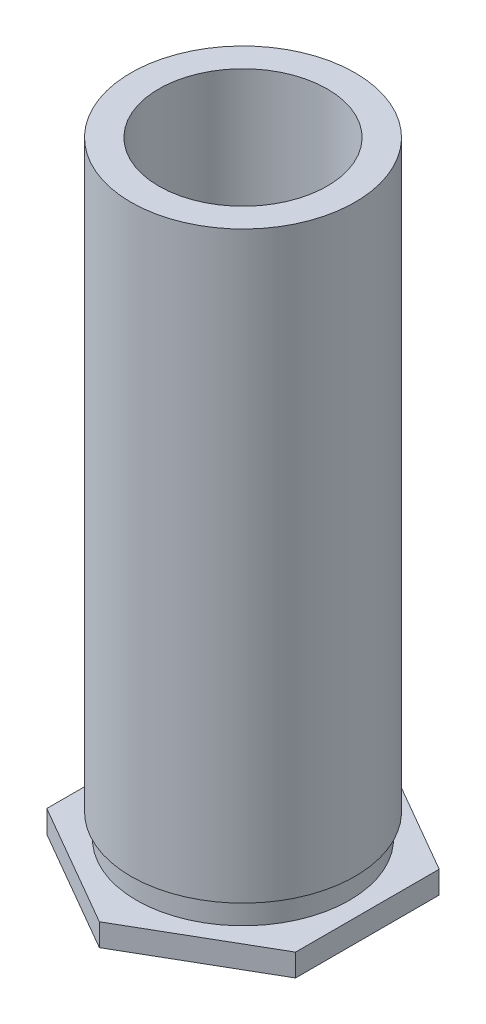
from build123d import *

# Parameters (mm, degrees)
THDSCHPAT_COUNT = 16
THDSCHPAT_PITCH = 0.7996
HEXDIESKE_R     = 4.5825
HEXDIE_DEPTH    = 0.712


with BuildPart() as part:
    # BodySke → Body (revolve)
    with BuildSketch(Plane.XY, mode=Mode.PRIVATE) as body_sk:
        Polygon((3.56, 0), (4.582, 0), (4.582, 0.712), (3.382, 0.712), (3.382, 1.4596), (3.56, 1.4596), (3.56, 20), (2.1, 20), (2.1, 0.006), (0, 0.006), (0, 0.00254), (3.56, 0.00254), align=None)
    revolve(body_sk.sketch.rotate(Axis((0, 0, 0), (0, 1, 0)), 90), axis=Axis((0, 0, 0), (0, 1, 0)))

    # TapDriSke → TapDrill (revolve, cut)
    with BuildSketch(Plane.XY, mode=Mode.PRIVATE) as tapdrill_sk:
        Polygon((2.1, -3.994), (2.1, 20), (0, 20), (0, -4.863848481), align=None)
    revolve(tapdrill_sk.sketch.rotate(Axis((0, 0, 0), (0, 1, 0)), 90), axis=Axis((0, 0, 0), (0, 1, 0)), mode=Mode.SUBTRACT)

    # EndChamferSke → EndChamfer (revolve, cut)
    with BuildSketch(Plane.XY, mode=Mode.PRIVATE) as endchamfer_sk:
        Polygon((2.675, 12), (2.675, 20.254), (2.1, 20.254), (2.1, 11.720021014), (2.5, 12), align=None)
    revolve(endchamfer_sk.sketch.rotate(Axis((0, -2.54, 0), (0, 1, 0)), 90), axis=Axis((0, -2.54, 0), (0, 1, 0)), mode=Mode.SUBTRACT)

    # ThdSchSke → ThreadSchematic (revolve, cut)
    with BuildSketch(Plane.XY, mode=Mode.PRIVATE) as threadschematic_sk:
        Polygon((2.5, 12), (2.1, 12.280083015), (2.1, 11.719916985), align=None)
    threadschematic = revolve(threadschematic_sk.sketch.rotate(Axis((0, -5.08, 0), (0, 1, 0)), 90), axis=Axis((0, -5.08, 0), (0, 1, 0)), mode=Mode.SUBTRACT)

    # ThdSchPat: ThreadSchematic ×16
    with Locations(*[(0, -i * THDSCHPAT_PITCH, 0) for i in range(1, THDSCHPAT_COUNT)]):
        add(threadschematic, mode=Mode.SUBTRACT)

    # HexDieSke → HexDie (cut)
    with BuildSketch(Plane(origin=(0, 0.712, 0), x_dir=(-1, 0, 0), z_dir=(0, 1, 0))):
        Circle(HEXDIESKE_R)
        Polygon((0, 4.561067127), (3.95, 2.280533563), (3.95, -2.280533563), (0, -4.561067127), (-3.95, -2.280533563), (-3.95, 2.280533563), align=None, mode=Mode.SUBTRACT)
    extrude(amount=-HEXDIE_DEPTH, mode=Mode.SUBTRACT)


solid = part.part
